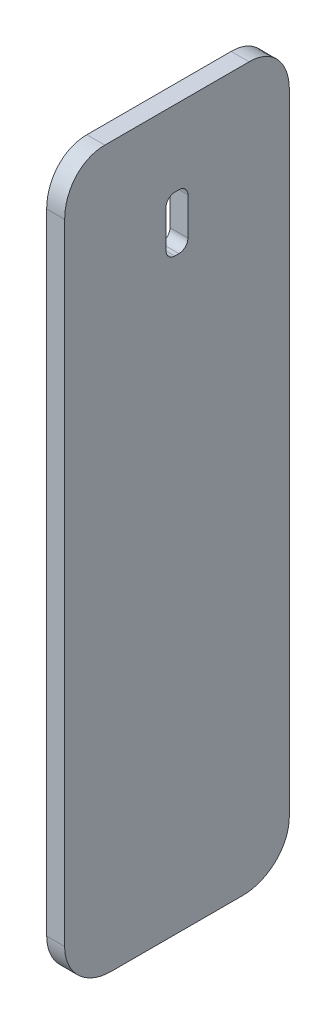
ISO-10303-21;
HEADER;
FILE_DESCRIPTION(('STEP AP214'),'2;1');
FILE_NAME('part.step','',(''),(''),'','','');
FILE_SCHEMA(('AUTOMOTIVE_DESIGN { 1 0 10303 214 1 1 1 1 }'));
ENDSEC;
DATA;
#1=APPLICATION_CONTEXT('core data for automotive mechanical design processes');
#2=APPLICATION_PROTOCOL_DEFINITION('international standard','automotive_design',2000,#1);
#3=PRODUCT_CONTEXT('',#1,'mechanical');
#4=PRODUCT('Part','Part','',(#3));
#5=PRODUCT_RELATED_PRODUCT_CATEGORY('part','',(#4));
#6=PRODUCT_DEFINITION_FORMATION('','',#4);
#7=PRODUCT_DEFINITION_CONTEXT('part definition',#1,'design');
#8=PRODUCT_DEFINITION('design','',#6,#7);
#9=PRODUCT_DEFINITION_SHAPE('','',#8);
#10=(LENGTH_UNIT() NAMED_UNIT(*) SI_UNIT(.MILLI.,.METRE.));
#11=(NAMED_UNIT(*) PLANE_ANGLE_UNIT() SI_UNIT($,.RADIAN.));
#12=(NAMED_UNIT(*) SI_UNIT($,.STERADIAN.) SOLID_ANGLE_UNIT());
#13=UNCERTAINTY_MEASURE_WITH_UNIT(LENGTH_MEASURE(1.E-05),#10,'distance_accuracy_value','');
#14=(GEOMETRIC_REPRESENTATION_CONTEXT(3) GLOBAL_UNCERTAINTY_ASSIGNED_CONTEXT((#13)) GLOBAL_UNIT_ASSIGNED_CONTEXT((#10,
#11,#12)) REPRESENTATION_CONTEXT('',''));
#15=CARTESIAN_POINT('',(0.,0.,0.));
#16=DIRECTION('',(0.,0.,1.));
#17=DIRECTION('',(1.,0.,0.));
#18=AXIS2_PLACEMENT_3D('',#15,#16,#17);
#19=CARTESIAN_POINT('',(-3.99999999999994,160.,-16.0608686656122));
#20=CARTESIAN_POINT('',(-3.99999999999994,160.,-16.6849530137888));
#21=CARTESIAN_POINT('',(-3.99999999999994,159.937674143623,-17.298813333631));
#22=CARTESIAN_POINT('',(-3.99999999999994,159.747851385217,-18.2038010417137));
#23=CARTESIAN_POINT('',(-3.99999999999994,159.668427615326,-18.5028144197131));
#24=CARTESIAN_POINT('',(-3.99999999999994,159.475499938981,-19.0952506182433));
#25=CARTESIAN_POINT('',(-3.99999999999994,159.362754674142,-19.3858257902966));
#26=CARTESIAN_POINT('',(-3.99999999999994,158.981028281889,-20.2291840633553));
#27=CARTESIAN_POINT('',(-3.99999999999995,158.667352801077,-20.7588100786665));
#28=CARTESIAN_POINT('',(-3.99999999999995,158.106942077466,-21.5037178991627));
#29=CARTESIAN_POINT('',(-3.99999999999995,157.905194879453,-21.7431077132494));
#30=CARTESIAN_POINT('',(-3.99999999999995,157.481727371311,-22.1940424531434));
#31=CARTESIAN_POINT('',(-3.99999999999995,157.258893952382,-22.4071435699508));
#32=CARTESIAN_POINT('',(-3.99999999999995,156.791870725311,-22.8095524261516));
#33=CARTESIAN_POINT('',(-3.99999999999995,156.547678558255,-22.9988575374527));
#34=CARTESIAN_POINT('',(-3.99999999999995,156.038219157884,-23.3539878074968));
#35=CARTESIAN_POINT('',(-3.99999999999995,155.772748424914,-23.519694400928));
#36=CARTESIAN_POINT('',(-3.99999999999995,154.961884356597,-23.9728150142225));
#37=CARTESIAN_POINT('',(-3.99999999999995,154.396917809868,-24.2204985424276));
#38=CARTESIAN_POINT('',(-3.99999999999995,153.515922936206,-24.5172100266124));
#39=CARTESIAN_POINT('',(-3.99999999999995,153.215503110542,-24.6037648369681));
#40=CARTESIAN_POINT('',(-3.99999999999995,152.612495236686,-24.7500698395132));
#41=CARTESIAN_POINT('',(-3.99999999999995,152.309219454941,-24.8101577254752));
#42=CARTESIAN_POINT('',(-3.99999999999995,151.394381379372,-24.9534749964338));
#43=CARTESIAN_POINT('',(-3.99999999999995,150.777841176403,-25.));
#44=CARTESIAN_POINT('',(-3.99999999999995,150.154991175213,-25.));
#45=B_SPLINE_CURVE_WITH_KNOTS('',3,(#19,#20,#21,#22,#23,#24,#25,#26,#27,#28,#29,#30,#31,#32,#33,
#34,#35,#36,#37,#38,#39,#40,#41,#42,#43,#44),.UNSPECIFIED.,.F.,.F.,(4,2,2,2,2,2,2,2,2,2,2,2,4),
(0.,0.124999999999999,0.187499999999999,0.249999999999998,0.375,0.437500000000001,
0.500000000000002,0.562500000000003,0.625000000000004,0.750000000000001,0.812499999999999,
0.874999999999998,1.),.UNSPECIFIED.);
#46=DIRECTION('',(1.,0.,0.));
#47=VECTOR('',#46,1.);
#48=SURFACE_OF_LINEAR_EXTRUSION('',#45,#47);
#49=CARTESIAN_POINT('',(0.,160.,-16.0608686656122));
#50=CARTESIAN_POINT('',(0.,160.,-16.6849530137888));
#51=CARTESIAN_POINT('',(0.,159.937674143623,-17.298813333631));
#52=CARTESIAN_POINT('',(0.,159.747851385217,-18.2038010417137));
#53=CARTESIAN_POINT('',(0.,159.668427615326,-18.5028144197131));
#54=CARTESIAN_POINT('',(0.,159.475499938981,-19.0952506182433));
#55=CARTESIAN_POINT('',(0.,159.362754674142,-19.3858257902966));
#56=CARTESIAN_POINT('',(0.,158.981028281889,-20.2291840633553));
#57=CARTESIAN_POINT('',(0.,158.667352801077,-20.7588100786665));
#58=CARTESIAN_POINT('',(0.,158.106942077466,-21.5037178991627));
#59=CARTESIAN_POINT('',(0.,157.905194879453,-21.7431077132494));
#60=CARTESIAN_POINT('',(0.,157.481727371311,-22.1940424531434));
#61=CARTESIAN_POINT('',(0.,157.258893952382,-22.4071435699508));
#62=CARTESIAN_POINT('',(0.,156.791870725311,-22.8095524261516));
#63=CARTESIAN_POINT('',(0.,156.547678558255,-22.9988575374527));
#64=CARTESIAN_POINT('',(0.,156.038219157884,-23.3539878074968));
#65=CARTESIAN_POINT('',(0.,155.772748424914,-23.519694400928));
#66=CARTESIAN_POINT('',(0.,154.961884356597,-23.9728150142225));
#67=CARTESIAN_POINT('',(0.,154.396917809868,-24.2204985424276));
#68=CARTESIAN_POINT('',(0.,153.515922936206,-24.5172100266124));
#69=CARTESIAN_POINT('',(0.,153.215503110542,-24.6037648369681));
#70=CARTESIAN_POINT('',(0.,152.612495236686,-24.7500698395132));
#71=CARTESIAN_POINT('',(0.,152.309219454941,-24.8101577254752));
#72=CARTESIAN_POINT('',(0.,151.394381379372,-24.9534749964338));
#73=CARTESIAN_POINT('',(0.,150.777841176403,-25.));
#74=CARTESIAN_POINT('',(0.,150.154991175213,-25.));
#75=B_SPLINE_CURVE_WITH_KNOTS('',3,(#49,#50,#51,#52,#53,#54,#55,#56,#57,#58,#59,#60,#61,#62,#63,
#64,#65,#66,#67,#68,#69,#70,#71,#72,#73,#74),.UNSPECIFIED.,.F.,.F.,(4,2,2,2,2,2,2,2,2,2,2,2,4),
(0.,0.124999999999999,0.187499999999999,0.249999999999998,0.375,0.437500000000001,
0.500000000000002,0.562500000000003,0.625000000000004,0.750000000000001,0.812499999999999,
0.874999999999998,1.),.UNSPECIFIED.);
#76=CARTESIAN_POINT('',(0.,160.,-16.0608686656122));
#77=VERTEX_POINT('',#76);
#78=CARTESIAN_POINT('',(0.,150.154991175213,-25.));
#79=VERTEX_POINT('',#78);
#80=EDGE_CURVE('E204',#77,#79,#75,.T.);
#81=ORIENTED_EDGE('',*,*,#80,.T.);
#82=DIRECTION('',(1.,0.,0.));
#83=VECTOR('',#82,1.);
#84=CARTESIAN_POINT('',(-3.99999999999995,150.154991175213,-25.));
#85=LINE('',#84,#83);
#86=CARTESIAN_POINT('',(-3.99999999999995,150.154991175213,-25.));
#87=VERTEX_POINT('',#86);
#88=EDGE_CURVE('E11',#87,#79,#85,.T.);
#89=ORIENTED_EDGE('',*,*,#88,.F.);
#90=CARTESIAN_POINT('',(-3.99999999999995,150.154991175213,-25.));
#91=CARTESIAN_POINT('',(-3.99999999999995,150.777841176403,-25.));
#92=CARTESIAN_POINT('',(-3.99999999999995,151.394381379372,-24.9534749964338));
#93=CARTESIAN_POINT('',(-3.99999999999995,152.309219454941,-24.8101577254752));
#94=CARTESIAN_POINT('',(-3.99999999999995,152.612495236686,-24.7500698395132));
#95=CARTESIAN_POINT('',(-3.99999999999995,153.215503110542,-24.6037648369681));
#96=CARTESIAN_POINT('',(-3.99999999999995,153.515922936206,-24.5172100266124));
#97=CARTESIAN_POINT('',(-3.99999999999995,154.396917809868,-24.2204985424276));
#98=CARTESIAN_POINT('',(-3.99999999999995,154.961884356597,-23.9728150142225));
#99=CARTESIAN_POINT('',(-3.99999999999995,155.772748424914,-23.519694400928));
#100=CARTESIAN_POINT('',(-3.99999999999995,156.038219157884,-23.3539878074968));
#101=CARTESIAN_POINT('',(-3.99999999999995,156.547678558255,-22.9988575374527));
#102=CARTESIAN_POINT('',(-3.99999999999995,156.791870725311,-22.8095524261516));
#103=CARTESIAN_POINT('',(-3.99999999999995,157.258893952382,-22.4071435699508));
#104=CARTESIAN_POINT('',(-3.99999999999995,157.481727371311,-22.1940424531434));
#105=CARTESIAN_POINT('',(-3.99999999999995,157.905194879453,-21.7431077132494));
#106=CARTESIAN_POINT('',(-3.99999999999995,158.106942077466,-21.5037178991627));
#107=CARTESIAN_POINT('',(-3.99999999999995,158.667352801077,-20.7588100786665));
#108=CARTESIAN_POINT('',(-3.99999999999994,158.981028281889,-20.2291840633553));
#109=CARTESIAN_POINT('',(-3.99999999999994,159.362754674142,-19.3858257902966));
#110=CARTESIAN_POINT('',(-3.99999999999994,159.475499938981,-19.0952506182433));
#111=CARTESIAN_POINT('',(-3.99999999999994,159.668427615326,-18.5028144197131));
#112=CARTESIAN_POINT('',(-3.99999999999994,159.747851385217,-18.2038010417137));
#113=CARTESIAN_POINT('',(-3.99999999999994,159.937674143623,-17.298813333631));
#114=CARTESIAN_POINT('',(-3.99999999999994,160.,-16.6849530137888));
#115=CARTESIAN_POINT('',(-3.99999999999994,160.,-16.0608686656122));
#116=B_SPLINE_CURVE_WITH_KNOTS('',3,(#90,#91,#92,#93,#94,#95,#96,#97,#98,#99,#100,#101,#102,
#103,#104,#105,#106,#107,#108,#109,#110,#111,#112,#113,#114,#115),.UNSPECIFIED.,.F.,.F.,(4,2,2,
2,2,2,2,2,2,2,2,2,4),(0.,0.125000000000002,0.187500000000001,0.249999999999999,
0.374999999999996,0.437499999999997,0.499999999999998,0.562499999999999,0.625,0.750000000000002,
0.812500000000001,0.875000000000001,1.),.UNSPECIFIED.);
#117=CARTESIAN_POINT('',(-3.99999999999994,160.,-16.0608686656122));
#118=VERTEX_POINT('',#117);
#119=EDGE_CURVE('E331',#118,#87,#116,.F.);
#120=ORIENTED_EDGE('',*,*,#119,.F.);
#121=DIRECTION('',(1.,0.,0.));
#122=VECTOR('',#121,1.);
#123=CARTESIAN_POINT('',(-3.99999999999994,160.,-16.0608686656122));
#124=LINE('',#123,#122);
#125=EDGE_CURVE('E423',#118,#77,#124,.T.);
#126=ORIENTED_EDGE('',*,*,#125,.T.);
#127=EDGE_LOOP('',(#81,#89,#120,#126));
#128=FACE_BOUND('',#127,.T.);
#129=ADVANCED_FACE('F32',(#128),#48,.F.);
#130=CARTESIAN_POINT('',(-3.99999999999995,150.154991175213,-25.));
#131=DIRECTION('',(0.,0.,1.));
#132=DIRECTION('',(0.,-1.,0.));
#133=AXIS2_PLACEMENT_3D('',#130,#131,#132);
#134=PLANE('',#133);
#135=DIRECTION('',(0.,-1.,0.));
#136=VECTOR('',#135,1.);
#137=CARTESIAN_POINT('',(0.,150.154991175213,-25.));
#138=LINE('',#137,#136);
#139=CARTESIAN_POINT('',(0.,10.,-25.));
#140=VERTEX_POINT('',#139);
#141=EDGE_CURVE('E268',#79,#140,#138,.T.);
#142=ORIENTED_EDGE('',*,*,#141,.T.);
#143=DIRECTION('',(1.,0.,0.));
#144=VECTOR('',#143,1.);
#145=CARTESIAN_POINT('',(-4.,10.,-25.));
#146=LINE('',#145,#144);
#147=CARTESIAN_POINT('',(-4.,10.,-25.));
#148=VERTEX_POINT('',#147);
#149=EDGE_CURVE('E42',#148,#140,#146,.T.);
#150=ORIENTED_EDGE('',*,*,#149,.F.);
#151=DIRECTION('',(0.,-1.,0.));
#152=VECTOR('',#151,1.);
#153=CARTESIAN_POINT('',(-3.99999999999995,150.154991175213,-25.));
#154=LINE('',#153,#152);
#155=EDGE_CURVE('E328',#87,#148,#154,.T.);
#156=ORIENTED_EDGE('',*,*,#155,.F.);
#157=ORIENTED_EDGE('',*,*,#88,.T.);
#158=EDGE_LOOP('',(#142,#150,#156,#157));
#159=FACE_BOUND('',#158,.T.);
#160=ADVANCED_FACE('F239',(#159),#134,.F.);
#161=CARTESIAN_POINT('',(-4.,10.,-25.));
#162=CARTESIAN_POINT('',(-4.,9.32765477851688,-25.));
#163=CARTESIAN_POINT('',(-4.,8.66723986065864,-24.930472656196));
#164=CARTESIAN_POINT('',(-4.,7.69371119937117,-24.7265629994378));
#165=CARTESIAN_POINT('',(-4.,7.37207265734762,-24.6418614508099));
#166=CARTESIAN_POINT('',(-4.,6.73466524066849,-24.4382511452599));
#167=CARTESIAN_POINT('',(-4.,6.41947589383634,-24.319269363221));
#168=CARTESIAN_POINT('',(-4.,5.50416854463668,-23.9194138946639));
#169=CARTESIAN_POINT('',(-4.,4.92663846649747,-23.5938783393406));
#170=CARTESIAN_POINT('',(-4.,4.10868213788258,-23.0183424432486));
#171=CARTESIAN_POINT('',(-4.,3.84289189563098,-22.8106396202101));
#172=CARTESIAN_POINT('',(-4.,3.33766788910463,-22.3735777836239));
#173=CARTESIAN_POINT('',(-4.,3.09741218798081,-22.1438643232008));
#174=CARTESIAN_POINT('',(-4.,2.41254928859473,-21.4222303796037));
#175=CARTESIAN_POINT('',(-4.,2.00261582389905,-20.896702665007));
#176=CARTESIAN_POINT('',(-4.,1.28370663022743,-19.7634864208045));
#177=CARTESIAN_POINT('',(-4.,0.983958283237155,-19.1709748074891));
#178=CARTESIAN_POINT('',(-4.,0.619406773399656,-18.2452994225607));
#179=CARTESIAN_POINT('',(-4.,0.512173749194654,-17.9305437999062));
#180=CARTESIAN_POINT('',(-4.,0.326758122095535,-17.2884290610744));
#181=CARTESIAN_POINT('',(-4.,0.248687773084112,-16.9607463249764));
#182=CARTESIAN_POINT('',(-4.,0.0624729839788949,-15.9762440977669));
#183=CARTESIAN_POINT('',(-4.,0.,-15.3122728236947));
#184=CARTESIAN_POINT('',(-4.,0.,-14.6405656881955));
#185=B_SPLINE_CURVE_WITH_KNOTS('',3,(#161,#162,#163,#164,#165,#166,#167,#168,#169,#170,#171,
#172,#173,#174,#175,#176,#177,#178,#179,#180,#181,#182,#183,#184),.UNSPECIFIED.,.F.,.F.,(4,2,2,
2,2,2,2,2,2,2,2,4),(0.,0.125,0.187500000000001,0.250000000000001,0.375000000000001,
0.437500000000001,0.500000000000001,0.625000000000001,0.750000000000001,0.8125,0.875,1.),.UNSPECIFIED.);
#186=DIRECTION('',(1.,0.,0.));
#187=VECTOR('',#186,1.);
#188=SURFACE_OF_LINEAR_EXTRUSION('',#185,#187);
#189=CARTESIAN_POINT('',(0.,10.,-25.));
#190=CARTESIAN_POINT('',(0.,9.32765477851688,-25.));
#191=CARTESIAN_POINT('',(0.,8.66723986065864,-24.930472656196));
#192=CARTESIAN_POINT('',(0.,7.69371119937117,-24.7265629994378));
#193=CARTESIAN_POINT('',(0.,7.37207265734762,-24.6418614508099));
#194=CARTESIAN_POINT('',(0.,6.73466524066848,-24.4382511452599));
#195=CARTESIAN_POINT('',(0.,6.41947589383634,-24.319269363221));
#196=CARTESIAN_POINT('',(0.,5.50416854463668,-23.9194138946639));
#197=CARTESIAN_POINT('',(0.,4.92663846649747,-23.5938783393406));
#198=CARTESIAN_POINT('',(0.,4.10868213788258,-23.0183424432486));
#199=CARTESIAN_POINT('',(0.,3.84289189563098,-22.8106396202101));
#200=CARTESIAN_POINT('',(0.,3.33766788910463,-22.3735777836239));
#201=CARTESIAN_POINT('',(0.,3.09741218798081,-22.1438643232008));
#202=CARTESIAN_POINT('',(0.,2.41254928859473,-21.4222303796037));
#203=CARTESIAN_POINT('',(0.,2.00261582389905,-20.896702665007));
#204=CARTESIAN_POINT('',(0.,1.28370663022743,-19.7634864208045));
#205=CARTESIAN_POINT('',(0.,0.983958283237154,-19.1709748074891));
#206=CARTESIAN_POINT('',(0.,0.619406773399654,-18.2452994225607));
#207=CARTESIAN_POINT('',(0.,0.512173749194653,-17.9305437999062));
#208=CARTESIAN_POINT('',(0.,0.326758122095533,-17.2884290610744));
#209=CARTESIAN_POINT('',(0.,0.24868777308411,-16.9607463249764));
#210=CARTESIAN_POINT('',(0.,0.0624729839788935,-15.9762440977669));
#211=CARTESIAN_POINT('',(0.,0.,-15.3122728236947));
#212=CARTESIAN_POINT('',(0.,0.,-14.6405656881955));
#213=B_SPLINE_CURVE_WITH_KNOTS('',3,(#189,#190,#191,#192,#193,#194,#195,#196,#197,#198,#199,
#200,#201,#202,#203,#204,#205,#206,#207,#208,#209,#210,#211,#212),.UNSPECIFIED.,.F.,.F.,(4,2,2,
2,2,2,2,2,2,2,2,4),(0.,0.125,0.187500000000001,0.250000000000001,0.375000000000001,
0.437500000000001,0.500000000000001,0.625000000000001,0.750000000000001,0.8125,0.875,1.),.UNSPECIFIED.);
#214=CARTESIAN_POINT('',(0.,0.,-14.6405656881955));
#215=VERTEX_POINT('',#214);
#216=EDGE_CURVE('E263',#140,#215,#213,.T.);
#217=ORIENTED_EDGE('',*,*,#216,.T.);
#218=DIRECTION('',(1.,0.,0.));
#219=VECTOR('',#218,1.);
#220=CARTESIAN_POINT('',(-4.,0.,-14.6405656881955));
#221=LINE('',#220,#219);
#222=CARTESIAN_POINT('',(-4.,0.,-14.6405656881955));
#223=VERTEX_POINT('',#222);
#224=EDGE_CURVE('E325',#223,#215,#221,.T.);
#225=ORIENTED_EDGE('',*,*,#224,.F.);
#226=CARTESIAN_POINT('',(-4.,0.,-14.6405656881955));
#227=CARTESIAN_POINT('',(-4.,0.,-15.3122728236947));
#228=CARTESIAN_POINT('',(-4.,0.0624729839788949,-15.9762440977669));
#229=CARTESIAN_POINT('',(-4.,0.248687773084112,-16.9607463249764));
#230=CARTESIAN_POINT('',(-4.,0.326758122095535,-17.2884290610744));
#231=CARTESIAN_POINT('',(-4.,0.512173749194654,-17.9305437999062));
#232=CARTESIAN_POINT('',(-4.,0.619406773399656,-18.2452994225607));
#233=CARTESIAN_POINT('',(-4.,0.983958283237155,-19.1709748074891));
#234=CARTESIAN_POINT('',(-4.,1.28370663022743,-19.7634864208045));
#235=CARTESIAN_POINT('',(-4.,2.00261582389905,-20.896702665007));
#236=CARTESIAN_POINT('',(-4.,2.41254928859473,-21.4222303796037));
#237=CARTESIAN_POINT('',(-4.,3.09741218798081,-22.1438643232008));
#238=CARTESIAN_POINT('',(-4.,3.33766788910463,-22.3735777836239));
#239=CARTESIAN_POINT('',(-4.,3.84289189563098,-22.8106396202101));
#240=CARTESIAN_POINT('',(-4.,4.10868213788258,-23.0183424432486));
#241=CARTESIAN_POINT('',(-4.,4.92663846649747,-23.5938783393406));
#242=CARTESIAN_POINT('',(-4.,5.50416854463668,-23.9194138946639));
#243=CARTESIAN_POINT('',(-4.,6.41947589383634,-24.319269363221));
#244=CARTESIAN_POINT('',(-4.,6.73466524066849,-24.4382511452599));
#245=CARTESIAN_POINT('',(-4.,7.37207265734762,-24.6418614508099));
#246=CARTESIAN_POINT('',(-4.,7.69371119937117,-24.7265629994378));
#247=CARTESIAN_POINT('',(-4.,8.66723986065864,-24.930472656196));
#248=CARTESIAN_POINT('',(-4.,9.32765477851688,-25.));
#249=CARTESIAN_POINT('',(-4.,10.,-25.));
#250=B_SPLINE_CURVE_WITH_KNOTS('',3,(#226,#227,#228,#229,#230,#231,#232,#233,#234,#235,#236,
#237,#238,#239,#240,#241,#242,#243,#244,#245,#246,#247,#248,#249),.UNSPECIFIED.,.F.,.F.,(4,2,2,
2,2,2,2,2,2,2,2,4),(0.,0.125,0.1875,0.249999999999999,0.374999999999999,0.499999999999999,
0.562499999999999,0.624999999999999,0.749999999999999,0.812499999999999,0.875,1.),.UNSPECIFIED.);
#251=EDGE_CURVE('E313',#148,#223,#250,.F.);
#252=ORIENTED_EDGE('',*,*,#251,.F.);
#253=ORIENTED_EDGE('',*,*,#149,.T.);
#254=EDGE_LOOP('',(#217,#225,#252,#253));
#255=FACE_BOUND('',#254,.T.);
#256=ADVANCED_FACE('F234',(#255),#188,.F.);
#257=CARTESIAN_POINT('',(-4.,0.,0.));
#258=DIRECTION('',(0.,1.,0.));
#259=DIRECTION('',(-1.,0.,0.));
#260=AXIS2_PLACEMENT_3D('',#257,#258,#259);
#261=PLANE('',#260);
#262=DIRECTION('',(0.,0.,1.));
#263=VECTOR('',#262,1.);
#264=CARTESIAN_POINT('',(0.,0.,0.));
#265=LINE('',#264,#263);
#266=CARTESIAN_POINT('',(0.,0.,14.6405656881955));
#267=VERTEX_POINT('',#266);
#268=EDGE_CURVE('E300',#215,#267,#265,.T.);
#269=ORIENTED_EDGE('',*,*,#268,.T.);
#270=DIRECTION('',(1.,0.,0.));
#271=VECTOR('',#270,1.);
#272=CARTESIAN_POINT('',(-4.,0.,14.6405656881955));
#273=LINE('',#272,#271);
#274=CARTESIAN_POINT('',(-4.,0.,14.6405656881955));
#275=VERTEX_POINT('',#274);
#276=EDGE_CURVE('E341',#275,#267,#273,.T.);
#277=ORIENTED_EDGE('',*,*,#276,.F.);
#278=DIRECTION('',(0.,0.,1.));
#279=VECTOR('',#278,1.);
#280=CARTESIAN_POINT('',(-4.,0.,-14.6405656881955));
#281=LINE('',#280,#279);
#282=EDGE_CURVE('E327',#223,#275,#281,.T.);
#283=ORIENTED_EDGE('',*,*,#282,.F.);
#284=ORIENTED_EDGE('',*,*,#224,.T.);
#285=EDGE_LOOP('',(#269,#277,#283,#284));
#286=FACE_BOUND('',#285,.T.);
#287=ADVANCED_FACE('F238',(#286),#261,.F.);
#288=CARTESIAN_POINT('',(-4.,0.,14.6405656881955));
#289=CARTESIAN_POINT('',(-4.,0.,15.3126579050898));
#290=CARTESIAN_POINT('',(-4.,0.062537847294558,15.9741669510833));
#291=CARTESIAN_POINT('',(-4.,0.246647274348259,16.9511487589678));
#292=CARTESIAN_POINT('',(-4.,0.323174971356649,17.2742442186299));
#293=CARTESIAN_POINT('',(-4.,0.507249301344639,17.9151858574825));
#294=CARTESIAN_POINT('',(-4.,0.61551066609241,18.2346322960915));
#295=CARTESIAN_POINT('',(-4.,0.982020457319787,19.1675719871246));
#296=CARTESIAN_POINT('',(-4.,1.28169466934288,19.7588015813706));
#297=CARTESIAN_POINT('',(-4.,1.81378558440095,20.5997849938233));
#298=CARTESIAN_POINT('',(-4.,2.00500616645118,20.87241727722));
#299=CARTESIAN_POINT('',(-4.,2.41630365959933,21.4016563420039));
#300=CARTESIAN_POINT('',(-4.,2.63534646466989,21.6566433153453));
#301=CARTESIAN_POINT('',(-4.,3.32174887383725,22.3809276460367));
#302=CARTESIAN_POINT('',(-4.,3.82191774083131,22.8149785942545));
#303=CARTESIAN_POINT('',(-4.,4.63747793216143,23.3911777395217));
#304=CARTESIAN_POINT('',(-4.,4.92200156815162,23.5715956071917));
#305=CARTESIAN_POINT('',(-4.,5.50512219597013,23.9009062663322));
#306=CARTESIAN_POINT('',(-4.,5.802842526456,24.0495737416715));
#307=CARTESIAN_POINT('',(-4.,6.71410300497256,24.4486003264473));
#308=CARTESIAN_POINT('',(-4.,7.34555776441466,24.6524634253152));
#309=CARTESIAN_POINT('',(-4.,8.33040952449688,24.8604894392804));
#310=CARTESIAN_POINT('',(-4.,8.66283798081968,24.9128235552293));
#311=CARTESIAN_POINT('',(-4.,9.32889781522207,24.9824602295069));
#312=CARTESIAN_POINT('',(-4.,9.66360008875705,25.));
#313=CARTESIAN_POINT('',(-4.,10.,25.));
#314=B_SPLINE_CURVE_WITH_KNOTS('',3,(#288,#289,#290,#291,#292,#293,#294,#295,#296,#297,#298,
#299,#300,#301,#302,#303,#304,#305,#306,#307,#308,#309,#310,#311,#312,#313),.UNSPECIFIED.,.F.,
.F.,(4,2,2,2,2,2,2,2,2,2,2,2,4),(0.,0.124999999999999,0.1875,0.25,0.374999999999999,
0.437499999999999,0.499999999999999,0.624999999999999,0.687499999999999,0.749999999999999,0.875,
0.9375,1.),.UNSPECIFIED.);
#315=DIRECTION('',(1.,0.,0.));
#316=VECTOR('',#315,1.);
#317=SURFACE_OF_LINEAR_EXTRUSION('',#314,#316);
#318=CARTESIAN_POINT('',(0.,0.,14.6405656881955));
#319=CARTESIAN_POINT('',(0.,0.,15.3126579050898));
#320=CARTESIAN_POINT('',(0.,0.0625378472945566,15.9741669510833));
#321=CARTESIAN_POINT('',(0.,0.246647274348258,16.9511487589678));
#322=CARTESIAN_POINT('',(0.,0.323174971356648,17.2742442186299));
#323=CARTESIAN_POINT('',(0.,0.507249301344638,17.9151858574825));
#324=CARTESIAN_POINT('',(0.,0.615510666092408,18.2346322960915));
#325=CARTESIAN_POINT('',(0.,0.982020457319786,19.1675719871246));
#326=CARTESIAN_POINT('',(0.,1.28169466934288,19.7588015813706));
#327=CARTESIAN_POINT('',(0.,1.81378558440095,20.5997849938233));
#328=CARTESIAN_POINT('',(0.,2.00500616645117,20.87241727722));
#329=CARTESIAN_POINT('',(0.,2.41630365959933,21.4016563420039));
#330=CARTESIAN_POINT('',(0.,2.63534646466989,21.6566433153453));
#331=CARTESIAN_POINT('',(0.,3.32174887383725,22.3809276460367));
#332=CARTESIAN_POINT('',(0.,3.82191774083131,22.8149785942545));
#333=CARTESIAN_POINT('',(0.,4.63747793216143,23.3911777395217));
#334=CARTESIAN_POINT('',(0.,4.92200156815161,23.5715956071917));
#335=CARTESIAN_POINT('',(0.,5.50512219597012,23.9009062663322));
#336=CARTESIAN_POINT('',(0.,5.80284252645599,24.0495737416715));
#337=CARTESIAN_POINT('',(0.,6.71410300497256,24.4486003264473));
#338=CARTESIAN_POINT('',(0.,7.34555776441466,24.6524634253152));
#339=CARTESIAN_POINT('',(0.,8.33040952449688,24.8604894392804));
#340=CARTESIAN_POINT('',(0.,8.66283798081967,24.9128235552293));
#341=CARTESIAN_POINT('',(0.,9.32889781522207,24.9824602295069));
#342=CARTESIAN_POINT('',(0.,9.66360008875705,25.));
#343=CARTESIAN_POINT('',(0.,10.,25.));
#344=B_SPLINE_CURVE_WITH_KNOTS('',3,(#318,#319,#320,#321,#322,#323,#324,#325,#326,#327,#328,
#329,#330,#331,#332,#333,#334,#335,#336,#337,#338,#339,#340,#341,#342,#343),.UNSPECIFIED.,.F.,
.F.,(4,2,2,2,2,2,2,2,2,2,2,2,4),(0.,0.124999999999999,0.1875,0.25,0.374999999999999,
0.437499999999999,0.499999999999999,0.624999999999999,0.687499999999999,0.749999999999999,0.875,
0.9375,1.),.UNSPECIFIED.);
#345=CARTESIAN_POINT('',(0.,10.,25.));
#346=VERTEX_POINT('',#345);
#347=EDGE_CURVE('E307',#267,#346,#344,.T.);
#348=ORIENTED_EDGE('',*,*,#347,.T.);
#349=DIRECTION('',(1.,0.,0.));
#350=VECTOR('',#349,1.);
#351=CARTESIAN_POINT('',(-4.,10.,25.));
#352=LINE('',#351,#350);
#353=CARTESIAN_POINT('',(-4.,10.,25.));
#354=VERTEX_POINT('',#353);
#355=EDGE_CURVE('E346',#354,#346,#352,.T.);
#356=ORIENTED_EDGE('',*,*,#355,.F.);
#357=CARTESIAN_POINT('',(-4.,10.,25.));
#358=CARTESIAN_POINT('',(-4.,9.66360008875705,25.));
#359=CARTESIAN_POINT('',(-4.,9.32889781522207,24.9824602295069));
#360=CARTESIAN_POINT('',(-4.,8.66283798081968,24.9128235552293));
#361=CARTESIAN_POINT('',(-4.,8.33040952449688,24.8604894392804));
#362=CARTESIAN_POINT('',(-4.,7.34555776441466,24.6524634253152));
#363=CARTESIAN_POINT('',(-4.,6.71410300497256,24.4486003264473));
#364=CARTESIAN_POINT('',(-4.,5.802842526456,24.0495737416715));
#365=CARTESIAN_POINT('',(-4.,5.50512219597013,23.9009062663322));
#366=CARTESIAN_POINT('',(-4.,4.92200156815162,23.5715956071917));
#367=CARTESIAN_POINT('',(-4.,4.63747793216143,23.3911777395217));
#368=CARTESIAN_POINT('',(-4.,3.82191774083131,22.8149785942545));
#369=CARTESIAN_POINT('',(-4.,3.32174887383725,22.3809276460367));
#370=CARTESIAN_POINT('',(-4.,2.63534646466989,21.6566433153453));
#371=CARTESIAN_POINT('',(-4.,2.41630365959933,21.4016563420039));
#372=CARTESIAN_POINT('',(-4.,2.00500616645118,20.87241727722));
#373=CARTESIAN_POINT('',(-4.,1.81378558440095,20.5997849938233));
#374=CARTESIAN_POINT('',(-4.,1.28169466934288,19.7588015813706));
#375=CARTESIAN_POINT('',(-4.,0.982020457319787,19.1675719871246));
#376=CARTESIAN_POINT('',(-4.,0.61551066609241,18.2346322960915));
#377=CARTESIAN_POINT('',(-4.,0.507249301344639,17.9151858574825));
#378=CARTESIAN_POINT('',(-4.,0.323174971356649,17.2742442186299));
#379=CARTESIAN_POINT('',(-4.,0.246647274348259,16.9511487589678));
#380=CARTESIAN_POINT('',(-4.,0.062537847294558,15.9741669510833));
#381=CARTESIAN_POINT('',(-4.,0.,15.3126579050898));
#382=CARTESIAN_POINT('',(-4.,0.,14.6405656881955));
#383=B_SPLINE_CURVE_WITH_KNOTS('',3,(#357,#358,#359,#360,#361,#362,#363,#364,#365,#366,#367,
#368,#369,#370,#371,#372,#373,#374,#375,#376,#377,#378,#379,#380,#381,#382),.UNSPECIFIED.,.F.,
.F.,(4,2,2,2,2,2,2,2,2,2,2,2,4),(0.,0.0625000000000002,0.125,0.250000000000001,
0.312500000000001,0.375000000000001,0.500000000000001,0.562500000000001,0.625000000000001,0.75,
0.8125,0.875000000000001,1.),.UNSPECIFIED.);
#384=EDGE_CURVE('E329',#275,#354,#383,.F.);
#385=ORIENTED_EDGE('',*,*,#384,.F.);
#386=ORIENTED_EDGE('',*,*,#276,.T.);
#387=EDGE_LOOP('',(#348,#356,#385,#386));
#388=FACE_BOUND('',#387,.T.);
#389=ADVANCED_FACE('F366',(#388),#317,.F.);
#390=CARTESIAN_POINT('',(-4.,10.,25.));
#391=DIRECTION('',(0.,0.,-1.));
#392=DIRECTION('',(-1.,0.,0.));
#393=AXIS2_PLACEMENT_3D('',#390,#391,#392);
#394=PLANE('',#393);
#395=DIRECTION('',(0.,1.,0.));
#396=VECTOR('',#395,1.);
#397=CARTESIAN_POINT('',(0.,10.,25.));
#398=LINE('',#397,#396);
#399=CARTESIAN_POINT('',(0.,150.154991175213,25.));
#400=VERTEX_POINT('',#399);
#401=EDGE_CURVE('E442',#346,#400,#398,.T.);
#402=ORIENTED_EDGE('',*,*,#401,.T.);
#403=DIRECTION('',(1.,0.,0.));
#404=VECTOR('',#403,1.);
#405=CARTESIAN_POINT('',(-3.99999999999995,150.154991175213,25.));
#406=LINE('',#405,#404);
#407=CARTESIAN_POINT('',(-3.99999999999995,150.154991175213,25.));
#408=VERTEX_POINT('',#407);
#409=EDGE_CURVE('E352',#408,#400,#406,.T.);
#410=ORIENTED_EDGE('',*,*,#409,.F.);
#411=DIRECTION('',(0.,1.,0.));
#412=VECTOR('',#411,1.);
#413=CARTESIAN_POINT('',(-4.,10.,25.));
#414=LINE('',#413,#412);
#415=EDGE_CURVE('E408',#354,#408,#414,.T.);
#416=ORIENTED_EDGE('',*,*,#415,.F.);
#417=ORIENTED_EDGE('',*,*,#355,.T.);
#418=EDGE_LOOP('',(#402,#410,#416,#417));
#419=FACE_BOUND('',#418,.T.);
#420=ADVANCED_FACE('F375',(#419),#394,.F.);
#421=CARTESIAN_POINT('',(-3.99999999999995,150.154991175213,25.));
#422=CARTESIAN_POINT('',(-3.99999999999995,150.778384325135,25.));
#423=CARTESIAN_POINT('',(-3.99999999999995,151.394341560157,24.9533863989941));
#424=CARTESIAN_POINT('',(-3.99999999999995,152.610759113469,24.7630135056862));
#425=CARTESIAN_POINT('',(-3.99999999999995,153.211239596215,24.6193806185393));
#426=CARTESIAN_POINT('',(-3.99999999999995,154.394590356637,24.2217215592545));
#427=CARTESIAN_POINT('',(-3.99999999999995,154.959103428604,23.9737063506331));
#428=CARTESIAN_POINT('',(-3.99999999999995,156.030106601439,23.376532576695));
#429=CARTESIAN_POINT('',(-3.99999999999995,156.536973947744,23.0274164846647));
#430=CARTESIAN_POINT('',(-3.99999999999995,157.485305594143,22.2137712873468));
#431=CARTESIAN_POINT('',(-3.99999999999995,157.909581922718,21.7633326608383));
#432=CARTESIAN_POINT('',(-3.99999999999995,158.465811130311,21.0279905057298));
#433=CARTESIAN_POINT('',(-3.99999999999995,158.638107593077,20.7725839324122));
#434=CARTESIAN_POINT('',(-3.99999999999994,158.955573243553,20.2404787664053));
#435=CARTESIAN_POINT('',(-3.99999999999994,159.101471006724,19.9618917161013));
#436=CARTESIAN_POINT('',(-3.99999999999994,159.487424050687,19.1127067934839));
#437=CARTESIAN_POINT('',(-3.99999999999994,159.678941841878,18.5260248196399));
#438=CARTESIAN_POINT('',(-3.99999999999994,159.871680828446,17.6164572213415));
#439=CARTESIAN_POINT('',(-3.99999999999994,159.920159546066,17.3070051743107));
#440=CARTESIAN_POINT('',(-3.99999999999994,159.984238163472,16.6855677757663));
#441=CARTESIAN_POINT('',(-3.99999999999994,160.,16.3737502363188));
#442=CARTESIAN_POINT('',(-3.99999999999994,160.,16.0608686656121));
#443=B_SPLINE_CURVE_WITH_KNOTS('',3,(#421,#422,#423,#424,#425,#426,#427,#428,#429,#430,#431,
#432,#433,#434,#435,#436,#437,#438,#439,#440,#441,#442),.UNSPECIFIED.,.F.,.F.,(4,2,2,2,2,2,2,2,
2,2,4),(0.,0.125000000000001,0.250000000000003,0.375000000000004,0.500000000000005,
0.625000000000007,0.687500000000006,0.750000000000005,0.875000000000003,0.937500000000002,1.),.UNSPECIFIED.);
#444=DIRECTION('',(1.,0.,0.));
#445=VECTOR('',#444,1.);
#446=SURFACE_OF_LINEAR_EXTRUSION('',#443,#445);
#447=CARTESIAN_POINT('',(0.,150.154991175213,25.));
#448=CARTESIAN_POINT('',(0.,150.778384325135,25.));
#449=CARTESIAN_POINT('',(0.,151.394341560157,24.9533863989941));
#450=CARTESIAN_POINT('',(0.,152.610759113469,24.7630135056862));
#451=CARTESIAN_POINT('',(0.,153.211239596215,24.6193806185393));
#452=CARTESIAN_POINT('',(0.,154.394590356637,24.2217215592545));
#453=CARTESIAN_POINT('',(0.,154.959103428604,23.9737063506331));
#454=CARTESIAN_POINT('',(0.,156.030106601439,23.376532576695));
#455=CARTESIAN_POINT('',(0.,156.536973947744,23.0274164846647));
#456=CARTESIAN_POINT('',(0.,157.485305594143,22.2137712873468));
#457=CARTESIAN_POINT('',(0.,157.909581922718,21.7633326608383));
#458=CARTESIAN_POINT('',(0.,158.465811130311,21.0279905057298));
#459=CARTESIAN_POINT('',(0.,158.638107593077,20.7725839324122));
#460=CARTESIAN_POINT('',(0.,158.955573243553,20.2404787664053));
#461=CARTESIAN_POINT('',(0.,159.101471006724,19.9618917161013));
#462=CARTESIAN_POINT('',(0.,159.487424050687,19.1127067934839));
#463=CARTESIAN_POINT('',(0.,159.678941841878,18.5260248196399));
#464=CARTESIAN_POINT('',(0.,159.871680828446,17.6164572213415));
#465=CARTESIAN_POINT('',(0.,159.920159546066,17.3070051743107));
#466=CARTESIAN_POINT('',(0.,159.984238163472,16.6855677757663));
#467=CARTESIAN_POINT('',(0.,160.,16.3737502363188));
#468=CARTESIAN_POINT('',(0.,160.,16.0608686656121));
#469=B_SPLINE_CURVE_WITH_KNOTS('',3,(#447,#448,#449,#450,#451,#452,#453,#454,#455,#456,#457,
#458,#459,#460,#461,#462,#463,#464,#465,#466,#467,#468),.UNSPECIFIED.,.F.,.F.,(4,2,2,2,2,2,2,2,
2,2,4),(0.,0.125000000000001,0.250000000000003,0.375000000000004,0.500000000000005,
0.625000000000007,0.687500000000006,0.750000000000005,0.875000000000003,0.937500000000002,1.),.UNSPECIFIED.);
#470=CARTESIAN_POINT('',(0.,160.,16.0608686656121));
#471=VERTEX_POINT('',#470);
#472=EDGE_CURVE('E433',#400,#471,#469,.T.);
#473=ORIENTED_EDGE('',*,*,#472,.T.);
#474=DIRECTION('',(1.,0.,0.));
#475=VECTOR('',#474,1.);
#476=CARTESIAN_POINT('',(-3.99999999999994,160.,16.0608686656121));
#477=LINE('',#476,#475);
#478=CARTESIAN_POINT('',(-3.99999999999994,160.,16.0608686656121));
#479=VERTEX_POINT('',#478);
#480=EDGE_CURVE('E418',#479,#471,#477,.T.);
#481=ORIENTED_EDGE('',*,*,#480,.F.);
#482=CARTESIAN_POINT('',(-3.99999999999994,160.,16.0608686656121));
#483=CARTESIAN_POINT('',(-3.99999999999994,160.,16.3737502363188));
#484=CARTESIAN_POINT('',(-3.99999999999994,159.984238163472,16.6855677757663));
#485=CARTESIAN_POINT('',(-3.99999999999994,159.920159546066,17.3070051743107));
#486=CARTESIAN_POINT('',(-3.99999999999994,159.871680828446,17.6164572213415));
#487=CARTESIAN_POINT('',(-3.99999999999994,159.678941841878,18.5260248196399));
#488=CARTESIAN_POINT('',(-3.99999999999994,159.487424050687,19.1127067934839));
#489=CARTESIAN_POINT('',(-3.99999999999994,159.101471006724,19.9618917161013));
#490=CARTESIAN_POINT('',(-3.99999999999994,158.955573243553,20.2404787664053));
#491=CARTESIAN_POINT('',(-3.99999999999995,158.638107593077,20.7725839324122));
#492=CARTESIAN_POINT('',(-3.99999999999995,158.465811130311,21.0279905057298));
#493=CARTESIAN_POINT('',(-3.99999999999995,157.909581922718,21.7633326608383));
#494=CARTESIAN_POINT('',(-3.99999999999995,157.485305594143,22.2137712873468));
#495=CARTESIAN_POINT('',(-3.99999999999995,156.536973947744,23.0274164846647));
#496=CARTESIAN_POINT('',(-3.99999999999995,156.030106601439,23.376532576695));
#497=CARTESIAN_POINT('',(-3.99999999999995,154.959103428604,23.9737063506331));
#498=CARTESIAN_POINT('',(-3.99999999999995,154.394590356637,24.2217215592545));
#499=CARTESIAN_POINT('',(-3.99999999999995,153.211239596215,24.6193806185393));
#500=CARTESIAN_POINT('',(-3.99999999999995,152.610759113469,24.7630135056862));
#501=CARTESIAN_POINT('',(-3.99999999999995,151.394341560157,24.9533863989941));
#502=CARTESIAN_POINT('',(-3.99999999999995,150.778384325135,25.));
#503=CARTESIAN_POINT('',(-3.99999999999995,150.154991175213,25.));
#504=B_SPLINE_CURVE_WITH_KNOTS('',3,(#482,#483,#484,#485,#486,#487,#488,#489,#490,#491,#492,
#493,#494,#495,#496,#497,#498,#499,#500,#501,#502,#503),.UNSPECIFIED.,.F.,.F.,(4,2,2,2,2,2,2,2,
2,2,4),(0.,0.0624999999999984,0.124999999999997,0.249999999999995,0.312499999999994,
0.374999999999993,0.499999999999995,0.624999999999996,0.749999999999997,0.874999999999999,1.),.UNSPECIFIED.);
#505=EDGE_CURVE('E394',#408,#479,#504,.F.);
#506=ORIENTED_EDGE('',*,*,#505,.F.);
#507=ORIENTED_EDGE('',*,*,#409,.T.);
#508=EDGE_LOOP('',(#473,#481,#506,#507));
#509=FACE_BOUND('',#508,.T.);
#510=ADVANCED_FACE('F378',(#509),#446,.F.);
#511=CARTESIAN_POINT('',(-3.99999999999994,160.,0.));
#512=DIRECTION('',(0.,-1.,0.));
#513=DIRECTION('',(1.,0.,0.));
#514=AXIS2_PLACEMENT_3D('',#511,#512,#513);
#515=PLANE('',#514);
#516=DIRECTION('',(0.,0.,-1.));
#517=VECTOR('',#516,1.);
#518=CARTESIAN_POINT('',(0.,160.,0.));
#519=LINE('',#518,#517);
#520=EDGE_CURVE('E333',#471,#77,#519,.T.);
#521=ORIENTED_EDGE('',*,*,#520,.T.);
#522=ORIENTED_EDGE('',*,*,#125,.F.);
#523=DIRECTION('',(0.,0.,-1.));
#524=VECTOR('',#523,1.);
#525=CARTESIAN_POINT('',(-3.99999999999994,160.,16.0608686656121));
#526=LINE('',#525,#524);
#527=EDGE_CURVE('E426',#479,#118,#526,.T.);
#528=ORIENTED_EDGE('',*,*,#527,.F.);
#529=ORIENTED_EDGE('',*,*,#480,.T.);
#530=EDGE_LOOP('',(#521,#522,#528,#529));
#531=FACE_BOUND('',#530,.T.);
#532=ADVANCED_FACE('F282',(#531),#515,.F.);
#533=CARTESIAN_POINT('',(-3.99999999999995,157.025382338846,-22.6083479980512));
#534=DIRECTION('',(1.,0.,0.));
#535=DIRECTION('',(0.,1.,0.));
#536=AXIS2_PLACEMENT_3D('',#533,#534,#535);
#537=PLANE('',#536);
#538=DIRECTION('',(0.,0.,1.));
#539=VECTOR('',#538,1.);
#540=CARTESIAN_POINT('',(-3.99999999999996,130.834716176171,0.436792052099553));
#541=LINE('',#540,#539);
#542=CARTESIAN_POINT('',(-3.99999999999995,130.834716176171,-0.436792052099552));
#543=VERTEX_POINT('',#542);
#544=CARTESIAN_POINT('',(-3.99999999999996,130.834716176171,0.436792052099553));
#545=VERTEX_POINT('',#544);
#546=EDGE_CURVE('E186',#543,#545,#541,.T.);
#547=ORIENTED_EDGE('',*,*,#546,.F.);
#548=CARTESIAN_POINT('',(-3.99999999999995,132.834716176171,-0.436792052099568));
#549=DIRECTION('',(-1.,0.,0.));
#550=DIRECTION('',(0.,1.,0.));
#551=AXIS2_PLACEMENT_3D('',#548,#549,#550);
#552=CIRCLE('',#551,2.);
#553=CARTESIAN_POINT('',(-3.99999999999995,132.834716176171,-2.43679205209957));
#554=VERTEX_POINT('',#553);
#555=EDGE_CURVE('E50',#554,#543,#552,.T.);
#556=ORIENTED_EDGE('',*,*,#555,.F.);
#557=DIRECTION('',(0.,-1.,0.));
#558=VECTOR('',#557,1.);
#559=CARTESIAN_POINT('',(-3.99999999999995,132.834716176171,-2.43679205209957));
#560=LINE('',#559,#558);
#561=CARTESIAN_POINT('',(-3.99999999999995,141.151214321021,-2.43679205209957));
#562=VERTEX_POINT('',#561);
#563=EDGE_CURVE('E166',#562,#554,#560,.T.);
#564=ORIENTED_EDGE('',*,*,#563,.F.);
#565=CARTESIAN_POINT('',(-3.99999999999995,141.151214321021,-0.436792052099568));
#566=DIRECTION('',(-1.,0.,0.));
#567=DIRECTION('',(0.,-1.,0.));
#568=AXIS2_PLACEMENT_3D('',#565,#566,#567);
#569=CIRCLE('',#568,2.);
#570=CARTESIAN_POINT('',(-3.99999999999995,143.151214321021,-0.436792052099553));
#571=VERTEX_POINT('',#570);
#572=EDGE_CURVE('E169',#571,#562,#569,.T.);
#573=ORIENTED_EDGE('',*,*,#572,.F.);
#574=DIRECTION('',(0.,0.,-1.));
#575=VECTOR('',#574,1.);
#576=CARTESIAN_POINT('',(-3.99999999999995,143.151214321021,0.436792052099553));
#577=LINE('',#576,#575);
#578=CARTESIAN_POINT('',(-3.99999999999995,143.151214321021,0.436792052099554));
#579=VERTEX_POINT('',#578);
#580=EDGE_CURVE('E197',#579,#571,#577,.T.);
#581=ORIENTED_EDGE('',*,*,#580,.F.);
#582=CARTESIAN_POINT('',(-3.99999999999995,141.151214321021,0.436792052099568));
#583=DIRECTION('',(-1.,0.,0.));
#584=DIRECTION('',(0.,-1.,0.));
#585=AXIS2_PLACEMENT_3D('',#582,#583,#584);
#586=CIRCLE('',#585,2.);
#587=CARTESIAN_POINT('',(-3.99999999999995,141.151214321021,2.43679205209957));
#588=VERTEX_POINT('',#587);
#589=EDGE_CURVE('E194',#588,#579,#586,.T.);
#590=ORIENTED_EDGE('',*,*,#589,.F.);
#591=DIRECTION('',(0.,1.,0.));
#592=VECTOR('',#591,1.);
#593=CARTESIAN_POINT('',(-3.99999999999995,132.834716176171,2.43679205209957));
#594=LINE('',#593,#592);
#595=CARTESIAN_POINT('',(-3.99999999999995,132.834716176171,2.43679205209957));
#596=VERTEX_POINT('',#595);
#597=EDGE_CURVE('E191',#596,#588,#594,.T.);
#598=ORIENTED_EDGE('',*,*,#597,.F.);
#599=CARTESIAN_POINT('',(-3.99999999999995,132.834716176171,0.436792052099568));
#600=DIRECTION('',(-1.,0.,0.));
#601=DIRECTION('',(0.,-1.,0.));
#602=AXIS2_PLACEMENT_3D('',#599,#600,#601);
#603=CIRCLE('',#602,2.);
#604=EDGE_CURVE('E188',#545,#596,#603,.T.);
#605=ORIENTED_EDGE('',*,*,#604,.F.);
#606=EDGE_LOOP('',(#547,#556,#564,#573,#581,#590,#598,#605));
#607=FACE_BOUND('',#606,.T.);
#608=ORIENTED_EDGE('',*,*,#119,.T.);
#609=ORIENTED_EDGE('',*,*,#155,.T.);
#610=ORIENTED_EDGE('',*,*,#251,.T.);
#611=ORIENTED_EDGE('',*,*,#282,.T.);
#612=ORIENTED_EDGE('',*,*,#384,.T.);
#613=ORIENTED_EDGE('',*,*,#415,.T.);
#614=ORIENTED_EDGE('',*,*,#505,.T.);
#615=ORIENTED_EDGE('',*,*,#527,.T.);
#616=EDGE_LOOP('',(#608,#609,#610,#611,#612,#613,#614,#615));
#617=FACE_BOUND('',#616,.T.);
#618=ADVANCED_FACE('F279',(#607,#617),#537,.F.);
#619=CARTESIAN_POINT('',(0.,157.025382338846,-22.6083479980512));
#620=DIRECTION('',(1.,0.,0.));
#621=DIRECTION('',(0.,1.,0.));
#622=AXIS2_PLACEMENT_3D('',#619,#620,#621);
#623=PLANE('',#622);
#624=ORIENTED_EDGE('',*,*,#216,.F.);
#625=ORIENTED_EDGE('',*,*,#141,.F.);
#626=ORIENTED_EDGE('',*,*,#80,.F.);
#627=ORIENTED_EDGE('',*,*,#520,.F.);
#628=ORIENTED_EDGE('',*,*,#472,.F.);
#629=ORIENTED_EDGE('',*,*,#401,.F.);
#630=ORIENTED_EDGE('',*,*,#347,.F.);
#631=ORIENTED_EDGE('',*,*,#268,.F.);
#632=EDGE_LOOP('',(#624,#625,#626,#627,#628,#629,#630,#631));
#633=FACE_BOUND('',#632,.T.);
#634=CARTESIAN_POINT('',(0.,132.834716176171,-0.436792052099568));
#635=DIRECTION('',(-1.,0.,0.));
#636=DIRECTION('',(0.,1.,0.));
#637=AXIS2_PLACEMENT_3D('',#634,#635,#636);
#638=CIRCLE('',#637,2.);
#639=CARTESIAN_POINT('',(0.,132.834716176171,-2.43679205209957));
#640=VERTEX_POINT('',#639);
#641=CARTESIAN_POINT('',(0.,130.834716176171,-0.436792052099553));
#642=VERTEX_POINT('',#641);
#643=EDGE_CURVE('E150',#640,#642,#638,.T.);
#644=ORIENTED_EDGE('',*,*,#643,.T.);
#645=DIRECTION('',(0.,0.,1.));
#646=VECTOR('',#645,1.);
#647=CARTESIAN_POINT('',(0.,130.834716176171,0.436792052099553));
#648=LINE('',#647,#646);
#649=CARTESIAN_POINT('',(0.,130.834716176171,0.436792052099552));
#650=VERTEX_POINT('',#649);
#651=EDGE_CURVE('E159',#642,#650,#648,.T.);
#652=ORIENTED_EDGE('',*,*,#651,.T.);
#653=CARTESIAN_POINT('',(0.,132.834716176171,0.436792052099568));
#654=DIRECTION('',(-1.,0.,0.));
#655=DIRECTION('',(0.,-1.,0.));
#656=AXIS2_PLACEMENT_3D('',#653,#654,#655);
#657=CIRCLE('',#656,2.);
#658=CARTESIAN_POINT('',(0.,132.834716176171,2.43679205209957));
#659=VERTEX_POINT('',#658);
#660=EDGE_CURVE('E58',#650,#659,#657,.T.);
#661=ORIENTED_EDGE('',*,*,#660,.T.);
#662=DIRECTION('',(0.,1.,0.));
#663=VECTOR('',#662,1.);
#664=CARTESIAN_POINT('',(0.,132.834716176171,2.43679205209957));
#665=LINE('',#664,#663);
#666=CARTESIAN_POINT('',(0.,141.151214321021,2.43679205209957));
#667=VERTEX_POINT('',#666);
#668=EDGE_CURVE('E173',#659,#667,#665,.T.);
#669=ORIENTED_EDGE('',*,*,#668,.T.);
#670=CARTESIAN_POINT('',(0.,141.151214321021,0.436792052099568));
#671=DIRECTION('',(-1.,0.,0.));
#672=DIRECTION('',(0.,-1.,0.));
#673=AXIS2_PLACEMENT_3D('',#670,#671,#672);
#674=CIRCLE('',#673,2.);
#675=CARTESIAN_POINT('',(0.,143.151214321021,0.436792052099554));
#676=VERTEX_POINT('',#675);
#677=EDGE_CURVE('E176',#667,#676,#674,.T.);
#678=ORIENTED_EDGE('',*,*,#677,.T.);
#679=DIRECTION('',(0.,0.,-1.));
#680=VECTOR('',#679,1.);
#681=CARTESIAN_POINT('',(0.,143.151214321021,0.436792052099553));
#682=LINE('',#681,#680);
#683=CARTESIAN_POINT('',(0.,143.151214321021,-0.436792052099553));
#684=VERTEX_POINT('',#683);
#685=EDGE_CURVE('E179',#676,#684,#682,.T.);
#686=ORIENTED_EDGE('',*,*,#685,.T.);
#687=CARTESIAN_POINT('',(0.,141.151214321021,-0.436792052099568));
#688=DIRECTION('',(-1.,0.,0.));
#689=DIRECTION('',(0.,-1.,0.));
#690=AXIS2_PLACEMENT_3D('',#687,#688,#689);
#691=CIRCLE('',#690,2.);
#692=CARTESIAN_POINT('',(0.,141.151214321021,-2.43679205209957));
#693=VERTEX_POINT('',#692);
#694=EDGE_CURVE('E182',#684,#693,#691,.T.);
#695=ORIENTED_EDGE('',*,*,#694,.T.);
#696=DIRECTION('',(0.,-1.,0.));
#697=VECTOR('',#696,1.);
#698=CARTESIAN_POINT('',(0.,132.834716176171,-2.43679205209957));
#699=LINE('',#698,#697);
#700=EDGE_CURVE('E156',#693,#640,#699,.T.);
#701=ORIENTED_EDGE('',*,*,#700,.T.);
#702=EDGE_LOOP('',(#644,#652,#661,#669,#678,#686,#695,#701));
#703=FACE_BOUND('',#702,.T.);
#704=ADVANCED_FACE('F163',(#633,#703),#623,.T.);
#705=CARTESIAN_POINT('',(0.,132.834716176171,-0.436792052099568));
#706=DIRECTION('',(-1.,0.,0.));
#707=DIRECTION('',(0.,-1.,0.));
#708=AXIS2_PLACEMENT_3D('',#705,#706,#707);
#709=CYLINDRICAL_SURFACE('',#708,2.);
#710=ORIENTED_EDGE('',*,*,#555,.T.);
#711=DIRECTION('',(-1.,0.,0.));
#712=VECTOR('',#711,1.);
#713=CARTESIAN_POINT('',(0.,130.834716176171,-0.436792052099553));
#714=LINE('',#713,#712);
#715=EDGE_CURVE('E146',#642,#543,#714,.T.);
#716=ORIENTED_EDGE('',*,*,#715,.F.);
#717=ORIENTED_EDGE('',*,*,#643,.F.);
#718=DIRECTION('',(-1.,0.,0.));
#719=VECTOR('',#718,1.);
#720=CARTESIAN_POINT('',(0.,132.834716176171,-2.43679205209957));
#721=LINE('',#720,#719);
#722=EDGE_CURVE('E202',#640,#554,#721,.T.);
#723=ORIENTED_EDGE('',*,*,#722,.T.);
#724=EDGE_LOOP('',(#710,#716,#717,#723));
#725=FACE_BOUND('',#724,.T.);
#726=ADVANCED_FACE('F148',(#725),#709,.F.);
#727=CARTESIAN_POINT('',(0.,132.834716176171,-2.43679205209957));
#728=DIRECTION('',(0.,0.,-1.));
#729=DIRECTION('',(-1.,0.,0.));
#730=AXIS2_PLACEMENT_3D('',#727,#728,#729);
#731=PLANE('',#730);
#732=ORIENTED_EDGE('',*,*,#563,.T.);
#733=ORIENTED_EDGE('',*,*,#722,.F.);
#734=ORIENTED_EDGE('',*,*,#700,.F.);
#735=DIRECTION('',(-1.,0.,0.));
#736=VECTOR('',#735,1.);
#737=CARTESIAN_POINT('',(0.,141.151214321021,-2.43679205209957));
#738=LINE('',#737,#736);
#739=EDGE_CURVE('E205',#693,#562,#738,.T.);
#740=ORIENTED_EDGE('',*,*,#739,.T.);
#741=EDGE_LOOP('',(#732,#733,#734,#740));
#742=FACE_BOUND('',#741,.T.);
#743=ADVANCED_FACE('F571',(#742),#731,.F.);
#744=CARTESIAN_POINT('',(0.,141.151214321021,-0.436792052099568));
#745=DIRECTION('',(-1.,0.,0.));
#746=DIRECTION('',(0.,-1.,0.));
#747=AXIS2_PLACEMENT_3D('',#744,#745,#746);
#748=CYLINDRICAL_SURFACE('',#747,2.);
#749=ORIENTED_EDGE('',*,*,#572,.T.);
#750=ORIENTED_EDGE('',*,*,#739,.F.);
#751=ORIENTED_EDGE('',*,*,#694,.F.);
#752=DIRECTION('',(-1.,0.,0.));
#753=VECTOR('',#752,1.);
#754=CARTESIAN_POINT('',(0.,143.151214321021,-0.436792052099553));
#755=LINE('',#754,#753);
#756=EDGE_CURVE('E207',#684,#571,#755,.T.);
#757=ORIENTED_EDGE('',*,*,#756,.T.);
#758=EDGE_LOOP('',(#749,#750,#751,#757));
#759=FACE_BOUND('',#758,.T.);
#760=ADVANCED_FACE('F580',(#759),#748,.F.);
#761=CARTESIAN_POINT('',(0.,143.151214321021,0.436792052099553));
#762=DIRECTION('',(0.,1.,0.));
#763=DIRECTION('',(-1.,0.,0.));
#764=AXIS2_PLACEMENT_3D('',#761,#762,#763);
#765=PLANE('',#764);
#766=ORIENTED_EDGE('',*,*,#580,.T.);
#767=ORIENTED_EDGE('',*,*,#756,.F.);
#768=ORIENTED_EDGE('',*,*,#685,.F.);
#769=DIRECTION('',(-1.,0.,0.));
#770=VECTOR('',#769,1.);
#771=CARTESIAN_POINT('',(0.,143.151214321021,0.436792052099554));
#772=LINE('',#771,#770);
#773=EDGE_CURVE('E209',#676,#579,#772,.T.);
#774=ORIENTED_EDGE('',*,*,#773,.T.);
#775=EDGE_LOOP('',(#766,#767,#768,#774));
#776=FACE_BOUND('',#775,.T.);
#777=ADVANCED_FACE('F590',(#776),#765,.F.);
#778=CARTESIAN_POINT('',(0.,141.151214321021,0.436792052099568));
#779=DIRECTION('',(-1.,0.,0.));
#780=DIRECTION('',(0.,-1.,0.));
#781=AXIS2_PLACEMENT_3D('',#778,#779,#780);
#782=CYLINDRICAL_SURFACE('',#781,2.);
#783=ORIENTED_EDGE('',*,*,#589,.T.);
#784=ORIENTED_EDGE('',*,*,#773,.F.);
#785=ORIENTED_EDGE('',*,*,#677,.F.);
#786=DIRECTION('',(-1.,0.,0.));
#787=VECTOR('',#786,1.);
#788=CARTESIAN_POINT('',(0.,141.151214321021,2.43679205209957));
#789=LINE('',#788,#787);
#790=EDGE_CURVE('E211',#667,#588,#789,.T.);
#791=ORIENTED_EDGE('',*,*,#790,.T.);
#792=EDGE_LOOP('',(#783,#784,#785,#791));
#793=FACE_BOUND('',#792,.T.);
#794=ADVANCED_FACE('F600',(#793),#782,.F.);
#795=CARTESIAN_POINT('',(0.,132.834716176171,2.43679205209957));
#796=DIRECTION('',(0.,0.,1.));
#797=DIRECTION('',(1.,0.,0.));
#798=AXIS2_PLACEMENT_3D('',#795,#796,#797);
#799=PLANE('',#798);
#800=ORIENTED_EDGE('',*,*,#597,.T.);
#801=ORIENTED_EDGE('',*,*,#790,.F.);
#802=ORIENTED_EDGE('',*,*,#668,.F.);
#803=DIRECTION('',(-1.,0.,0.));
#804=VECTOR('',#803,1.);
#805=CARTESIAN_POINT('',(0.,132.834716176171,2.43679205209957));
#806=LINE('',#805,#804);
#807=EDGE_CURVE('E213',#659,#596,#806,.T.);
#808=ORIENTED_EDGE('',*,*,#807,.T.);
#809=EDGE_LOOP('',(#800,#801,#802,#808));
#810=FACE_BOUND('',#809,.T.);
#811=ADVANCED_FACE('F610',(#810),#799,.F.);
#812=CARTESIAN_POINT('',(0.,132.834716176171,0.436792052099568));
#813=DIRECTION('',(-1.,0.,0.));
#814=DIRECTION('',(0.,-1.,0.));
#815=AXIS2_PLACEMENT_3D('',#812,#813,#814);
#816=CYLINDRICAL_SURFACE('',#815,2.);
#817=ORIENTED_EDGE('',*,*,#604,.T.);
#818=ORIENTED_EDGE('',*,*,#807,.F.);
#819=ORIENTED_EDGE('',*,*,#660,.F.);
#820=DIRECTION('',(-1.,0.,0.));
#821=VECTOR('',#820,1.);
#822=CARTESIAN_POINT('',(0.,130.834716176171,0.436792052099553));
#823=LINE('',#822,#821);
#824=EDGE_CURVE('E155',#650,#545,#823,.T.);
#825=ORIENTED_EDGE('',*,*,#824,.T.);
#826=EDGE_LOOP('',(#817,#818,#819,#825));
#827=FACE_BOUND('',#826,.T.);
#828=ADVANCED_FACE('F620',(#827),#816,.F.);
#829=CARTESIAN_POINT('',(0.,130.834716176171,0.436792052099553));
#830=DIRECTION('',(0.,-1.,0.));
#831=DIRECTION('',(1.,0.,0.));
#832=AXIS2_PLACEMENT_3D('',#829,#830,#831);
#833=PLANE('',#832);
#834=ORIENTED_EDGE('',*,*,#546,.T.);
#835=ORIENTED_EDGE('',*,*,#824,.F.);
#836=ORIENTED_EDGE('',*,*,#651,.F.);
#837=ORIENTED_EDGE('',*,*,#715,.T.);
#838=EDGE_LOOP('',(#834,#835,#836,#837));
#839=FACE_BOUND('',#838,.T.);
#840=ADVANCED_FACE('F160',(#839),#833,.F.);
#841=CLOSED_SHELL('',(#129,#160,#256,#287,#389,#420,#510,#532,#618,#704,#726,#743,#760,#777,
#794,#811,#828,#840));
#842=MANIFOLD_SOLID_BREP('B2',#841);
#843=ADVANCED_BREP_SHAPE_REPRESENTATION('',(#18,#842),#14);
#844=SHAPE_DEFINITION_REPRESENTATION(#9,#843);
ENDSEC;
END-ISO-10303-21;
